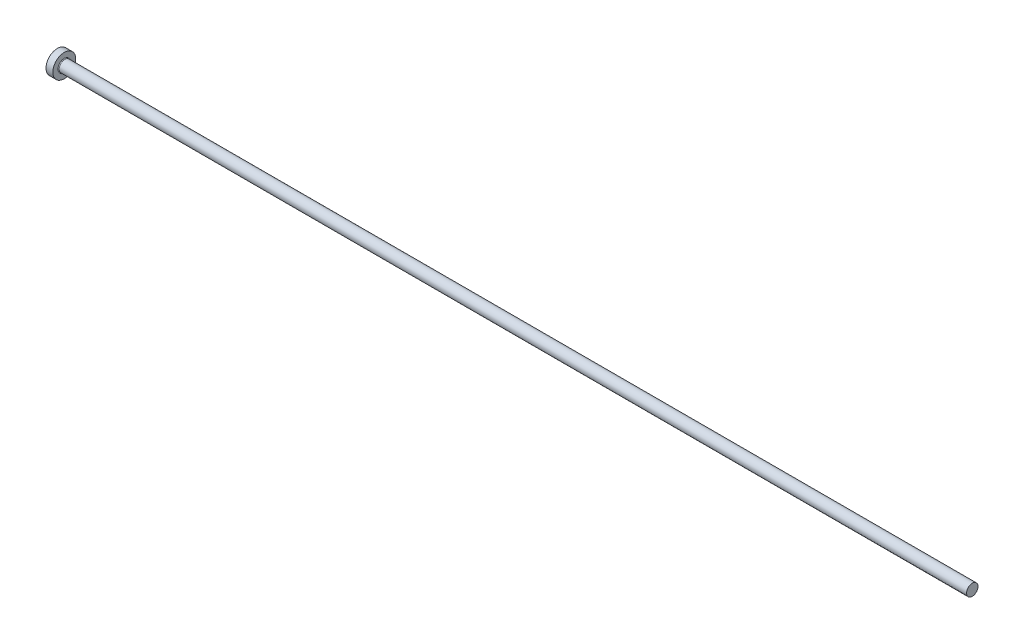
ISO-10303-21;
HEADER;
FILE_DESCRIPTION(('STEP AP214'),'2;1');
FILE_NAME('part.step','',(''),(''),'','','');
FILE_SCHEMA(('AUTOMOTIVE_DESIGN { 1 0 10303 214 1 1 1 1 }'));
ENDSEC;
DATA;
#1=APPLICATION_CONTEXT('core data for automotive mechanical design processes');
#2=APPLICATION_PROTOCOL_DEFINITION('international standard','automotive_design',2000,#1);
#3=PRODUCT_CONTEXT('',#1,'mechanical');
#4=PRODUCT('Part','Part','',(#3));
#5=PRODUCT_RELATED_PRODUCT_CATEGORY('part','',(#4));
#6=PRODUCT_DEFINITION_FORMATION('','',#4);
#7=PRODUCT_DEFINITION_CONTEXT('part definition',#1,'design');
#8=PRODUCT_DEFINITION('design','',#6,#7);
#9=PRODUCT_DEFINITION_SHAPE('','',#8);
#10=(LENGTH_UNIT() NAMED_UNIT(*) SI_UNIT(.MILLI.,.METRE.));
#11=(NAMED_UNIT(*) PLANE_ANGLE_UNIT() SI_UNIT($,.RADIAN.));
#12=(NAMED_UNIT(*) SI_UNIT($,.STERADIAN.) SOLID_ANGLE_UNIT());
#13=UNCERTAINTY_MEASURE_WITH_UNIT(LENGTH_MEASURE(1.E-05),#10,'distance_accuracy_value','');
#14=(GEOMETRIC_REPRESENTATION_CONTEXT(3) GLOBAL_UNCERTAINTY_ASSIGNED_CONTEXT((#13)) GLOBAL_UNIT_ASSIGNED_CONTEXT((#10,
#11,#12)) REPRESENTATION_CONTEXT('',''));
#15=CARTESIAN_POINT('',(0.,0.,0.));
#16=DIRECTION('',(0.,0.,1.));
#17=DIRECTION('',(1.,0.,0.));
#18=AXIS2_PLACEMENT_3D('',#15,#16,#17);
#19=CARTESIAN_POINT('',(0.,0.,0.));
#20=DIRECTION('',(-1.,0.,0.));
#21=DIRECTION('',(0.,-1.,0.));
#22=AXIS2_PLACEMENT_3D('',#19,#20,#21);
#23=PLANE('',#22);
#24=CARTESIAN_POINT('',(0.,0.,0.));
#25=DIRECTION('',(1.,0.,0.));
#26=DIRECTION('',(0.,1.,0.));
#27=AXIS2_PLACEMENT_3D('',#24,#25,#26);
#28=CIRCLE('',#27,5.);
#29=CARTESIAN_POINT('',(0.,5.,0.));
#30=VERTEX_POINT('',#29);
#31=EDGE_CURVE('E25',#30,#30,#28,.T.);
#32=ORIENTED_EDGE('',*,*,#31,.F.);
#33=EDGE_LOOP('',(#32));
#34=FACE_BOUND('',#33,.T.);
#35=ADVANCED_FACE('F14',(#34),#23,.T.);
#36=CARTESIAN_POINT('',(400.,0.,0.));
#37=DIRECTION('',(1.,0.,0.));
#38=DIRECTION('',(0.,1.,0.));
#39=AXIS2_PLACEMENT_3D('',#36,#37,#38);
#40=CYLINDRICAL_SURFACE('',#39,5.);
#41=ORIENTED_EDGE('',*,*,#31,.T.);
#42=EDGE_LOOP('',(#41));
#43=FACE_BOUND('',#42,.T.);
#44=CARTESIAN_POINT('',(3.,0.,0.));
#45=DIRECTION('',(1.,0.,0.));
#46=DIRECTION('',(0.,1.,0.));
#47=AXIS2_PLACEMENT_3D('',#44,#45,#46);
#48=CIRCLE('',#47,5.);
#49=CARTESIAN_POINT('',(3.,5.,0.));
#50=VERTEX_POINT('',#49);
#51=EDGE_CURVE('E29',#50,#50,#48,.T.);
#52=ORIENTED_EDGE('',*,*,#51,.F.);
#53=EDGE_LOOP('',(#52));
#54=FACE_BOUND('',#53,.T.);
#55=ADVANCED_FACE('F51',(#43,#54),#40,.T.);
#56=CARTESIAN_POINT('',(3.,5.,0.));
#57=DIRECTION('',(1.,0.,0.));
#58=DIRECTION('',(0.,1.,0.));
#59=AXIS2_PLACEMENT_3D('',#56,#57,#58);
#60=PLANE('',#59);
#61=CARTESIAN_POINT('',(3.,0.,0.));
#62=DIRECTION('',(1.,0.,0.));
#63=DIRECTION('',(0.,1.,0.));
#64=AXIS2_PLACEMENT_3D('',#61,#62,#63);
#65=CIRCLE('',#64,2.79999999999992);
#66=CARTESIAN_POINT('',(3.,2.79999999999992,0.));
#67=VERTEX_POINT('',#66);
#68=EDGE_CURVE('E9',#67,#67,#65,.F.);
#69=ORIENTED_EDGE('',*,*,#68,.T.);
#70=EDGE_LOOP('',(#69));
#71=FACE_BOUND('',#70,.T.);
#72=ORIENTED_EDGE('',*,*,#51,.T.);
#73=EDGE_LOOP('',(#72));
#74=FACE_BOUND('',#73,.T.);
#75=ADVANCED_FACE('F42',(#71,#74),#60,.T.);
#76=CARTESIAN_POINT('',(400.,0.,0.));
#77=DIRECTION('',(1.,0.,0.));
#78=DIRECTION('',(0.,1.,0.));
#79=AXIS2_PLACEMENT_3D('',#76,#77,#78);
#80=CYLINDRICAL_SURFACE('',#79,2.49999999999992);
#81=CARTESIAN_POINT('',(3.3,0.,0.));
#82=DIRECTION('',(1.,0.,0.));
#83=DIRECTION('',(0.,1.,0.));
#84=AXIS2_PLACEMENT_3D('',#81,#82,#83);
#85=CIRCLE('',#84,2.49999999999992);
#86=CARTESIAN_POINT('',(3.3,2.49999999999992,0.));
#87=VERTEX_POINT('',#86);
#88=EDGE_CURVE('E21',#87,#87,#85,.T.);
#89=ORIENTED_EDGE('',*,*,#88,.T.);
#90=EDGE_LOOP('',(#89));
#91=FACE_BOUND('',#90,.T.);
#92=CARTESIAN_POINT('',(400.,0.,0.));
#93=DIRECTION('',(1.,0.,0.));
#94=DIRECTION('',(0.,1.,0.));
#95=AXIS2_PLACEMENT_3D('',#92,#93,#94);
#96=CIRCLE('',#95,2.49999999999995);
#97=CARTESIAN_POINT('',(400.,2.49999999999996,0.));
#98=VERTEX_POINT('',#97);
#99=EDGE_CURVE('E34',#98,#98,#96,.T.);
#100=ORIENTED_EDGE('',*,*,#99,.F.);
#101=EDGE_LOOP('',(#100));
#102=FACE_BOUND('',#101,.T.);
#103=ADVANCED_FACE('F40',(#91,#102),#80,.T.);
#104=CARTESIAN_POINT('',(400.,2.49999999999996,0.));
#105=DIRECTION('',(1.,0.,0.));
#106=DIRECTION('',(0.,1.,0.));
#107=AXIS2_PLACEMENT_3D('',#104,#105,#106);
#108=PLANE('',#107);
#109=ORIENTED_EDGE('',*,*,#99,.T.);
#110=EDGE_LOOP('',(#109));
#111=FACE_BOUND('',#110,.T.);
#112=ADVANCED_FACE('F38',(#111),#108,.T.);
#113=CARTESIAN_POINT('',(3.3,0.,0.));
#114=DIRECTION('',(1.,0.,0.));
#115=DIRECTION('',(0.,1.,0.));
#116=AXIS2_PLACEMENT_3D('',#113,#114,#115);
#117=TOROIDAL_SURFACE('',#116,2.79999999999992,0.3);
#118=ORIENTED_EDGE('',*,*,#68,.F.);
#119=EDGE_LOOP('',(#118));
#120=FACE_BOUND('',#119,.T.);
#121=ORIENTED_EDGE('',*,*,#88,.F.);
#122=EDGE_LOOP('',(#121));
#123=FACE_BOUND('',#122,.T.);
#124=ADVANCED_FACE('F16',(#120,#123),#117,.F.);
#125=CLOSED_SHELL('',(#35,#55,#75,#103,#112,#124));
#126=MANIFOLD_SOLID_BREP('B1',#125);
#127=ADVANCED_BREP_SHAPE_REPRESENTATION('',(#18,#126),#14);
#128=SHAPE_DEFINITION_REPRESENTATION(#9,#127);
ENDSEC;
END-ISO-10303-21;
